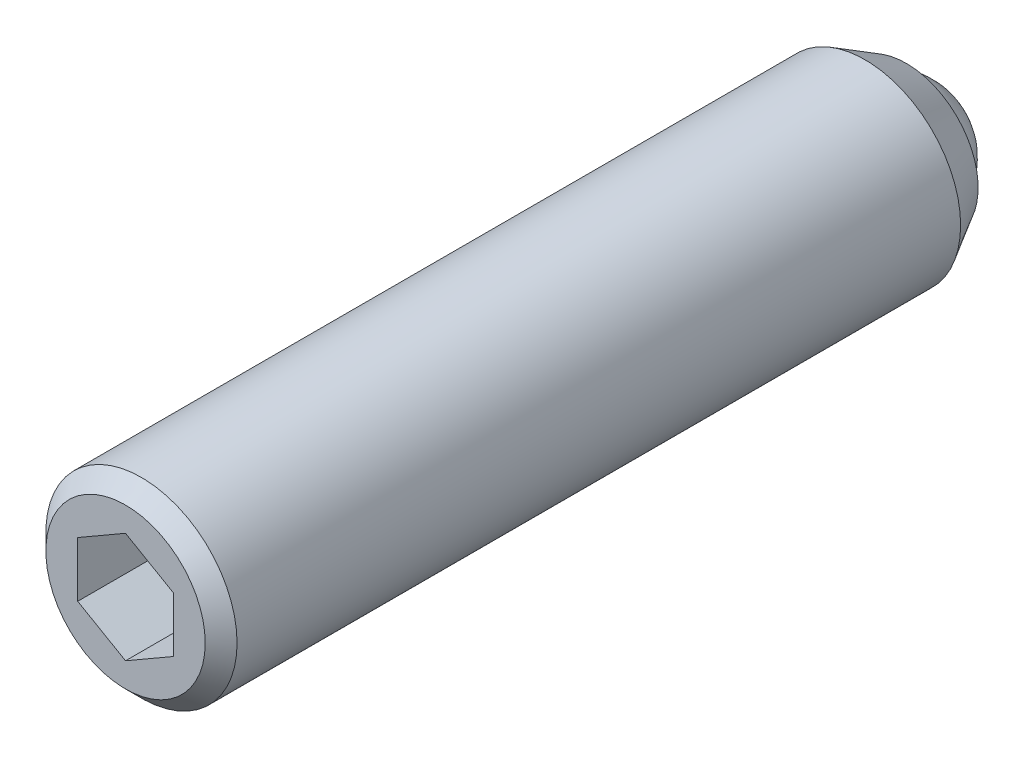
ISO-10303-21;
HEADER;
FILE_DESCRIPTION(('STEP AP214'),'2;1');
FILE_NAME('part.step','',(''),(''),'','','');
FILE_SCHEMA(('AUTOMOTIVE_DESIGN { 1 0 10303 214 1 1 1 1 }'));
ENDSEC;
DATA;
#1=APPLICATION_CONTEXT('core data for automotive mechanical design processes');
#2=APPLICATION_PROTOCOL_DEFINITION('international standard','automotive_design',2000,#1);
#3=PRODUCT_CONTEXT('',#1,'mechanical');
#4=PRODUCT('Part','Part','',(#3));
#5=PRODUCT_RELATED_PRODUCT_CATEGORY('part','',(#4));
#6=PRODUCT_DEFINITION_FORMATION('','',#4);
#7=PRODUCT_DEFINITION_CONTEXT('part definition',#1,'design');
#8=PRODUCT_DEFINITION('design','',#6,#7);
#9=PRODUCT_DEFINITION_SHAPE('','',#8);
#10=(LENGTH_UNIT() NAMED_UNIT(*) SI_UNIT(.MILLI.,.METRE.));
#11=(NAMED_UNIT(*) PLANE_ANGLE_UNIT() SI_UNIT($,.RADIAN.));
#12=(NAMED_UNIT(*) SI_UNIT($,.STERADIAN.) SOLID_ANGLE_UNIT());
#13=UNCERTAINTY_MEASURE_WITH_UNIT(LENGTH_MEASURE(1.E-05),#10,'distance_accuracy_value','');
#14=(GEOMETRIC_REPRESENTATION_CONTEXT(3) GLOBAL_UNCERTAINTY_ASSIGNED_CONTEXT((#13)) GLOBAL_UNIT_ASSIGNED_CONTEXT((#10,
#11,#12)) REPRESENTATION_CONTEXT('',''));
#15=CARTESIAN_POINT('',(0.,0.,0.));
#16=DIRECTION('',(0.,0.,1.));
#17=DIRECTION('',(1.,0.,0.));
#18=AXIS2_PLACEMENT_3D('',#15,#16,#17);
#19=CARTESIAN_POINT('',(1.5,0.866025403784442,23.4));
#20=DIRECTION('',(0.5,0.86602540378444,0.));
#21=DIRECTION('',(0.86602540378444,-0.5,0.));
#22=AXIS2_PLACEMENT_3D('',#19,#20,#21);
#23=PLANE('',#22);
#24=DIRECTION('',(0.,0.,1.));
#25=VECTOR('',#24,1.);
#26=CARTESIAN_POINT('',(1.5,0.866025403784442,23.4));
#27=LINE('',#26,#25);
#28=CARTESIAN_POINT('',(1.5,0.866025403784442,22.9));
#29=VERTEX_POINT('',#28);
#30=CARTESIAN_POINT('',(1.5,0.866025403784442,25.9));
#31=VERTEX_POINT('',#30);
#32=EDGE_CURVE('E68',#29,#31,#27,.T.);
#33=ORIENTED_EDGE('',*,*,#32,.T.);
#34=DIRECTION('',(-0.86602540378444,0.5,0.));
#35=VECTOR('',#34,1.);
#36=CARTESIAN_POINT('',(1.5,0.866025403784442,25.9));
#37=LINE('',#36,#35);
#38=CARTESIAN_POINT('',(0.,1.73205080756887,25.9));
#39=VERTEX_POINT('',#38);
#40=EDGE_CURVE('E29',#31,#39,#37,.T.);
#41=ORIENTED_EDGE('',*,*,#40,.T.);
#42=DIRECTION('',(0.,0.,1.));
#43=VECTOR('',#42,1.);
#44=CARTESIAN_POINT('',(0.,1.73205080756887,23.4));
#45=LINE('',#44,#43);
#46=CARTESIAN_POINT('',(0.,1.73205080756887,22.9));
#47=VERTEX_POINT('',#46);
#48=EDGE_CURVE('E80',#47,#39,#45,.T.);
#49=ORIENTED_EDGE('',*,*,#48,.F.);
#50=DIRECTION('',(-0.86602540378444,0.5,0.));
#51=VECTOR('',#50,1.);
#52=CARTESIAN_POINT('',(1.5,0.866025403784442,22.9));
#53=LINE('',#52,#51);
#54=EDGE_CURVE('E79',#29,#47,#53,.T.);
#55=ORIENTED_EDGE('',*,*,#54,.F.);
#56=EDGE_LOOP('',(#33,#41,#49,#55));
#57=FACE_BOUND('',#56,.T.);
#58=ADVANCED_FACE('F14',(#57),#23,.F.);
#59=CARTESIAN_POINT('',(1.5,-0.866025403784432,23.4));
#60=DIRECTION('',(1.,0.,0.));
#61=DIRECTION('',(0.,-1.,0.));
#62=AXIS2_PLACEMENT_3D('',#59,#60,#61);
#63=PLANE('',#62);
#64=DIRECTION('',(0.,0.,1.));
#65=VECTOR('',#64,1.);
#66=CARTESIAN_POINT('',(1.5,-0.866025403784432,23.4));
#67=LINE('',#66,#65);
#68=CARTESIAN_POINT('',(1.5,-0.866025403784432,22.9));
#69=VERTEX_POINT('',#68);
#70=CARTESIAN_POINT('',(1.5,-0.866025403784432,25.9));
#71=VERTEX_POINT('',#70);
#72=EDGE_CURVE('E76',#69,#71,#67,.T.);
#73=ORIENTED_EDGE('',*,*,#72,.T.);
#74=DIRECTION('',(0.,1.,0.));
#75=VECTOR('',#74,1.);
#76=CARTESIAN_POINT('',(1.5,-0.866025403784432,25.9));
#77=LINE('',#76,#75);
#78=EDGE_CURVE('E75',#71,#31,#77,.T.);
#79=ORIENTED_EDGE('',*,*,#78,.T.);
#80=ORIENTED_EDGE('',*,*,#32,.F.);
#81=DIRECTION('',(0.,1.,0.));
#82=VECTOR('',#81,1.);
#83=CARTESIAN_POINT('',(1.5,-0.866025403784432,22.9));
#84=LINE('',#83,#82);
#85=EDGE_CURVE('E72',#69,#29,#84,.T.);
#86=ORIENTED_EDGE('',*,*,#85,.F.);
#87=EDGE_LOOP('',(#73,#79,#80,#86));
#88=FACE_BOUND('',#87,.T.);
#89=ADVANCED_FACE('F70',(#88),#63,.F.);
#90=CARTESIAN_POINT('',(1.5,-0.866025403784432,23.4));
#91=DIRECTION('',(-0.5,0.866025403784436,0.));
#92=DIRECTION('',(0.866025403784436,0.5,0.));
#93=AXIS2_PLACEMENT_3D('',#90,#91,#92);
#94=PLANE('',#93);
#95=DIRECTION('',(0.,0.,1.));
#96=VECTOR('',#95,1.);
#97=CARTESIAN_POINT('',(0.,-1.73205080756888,23.4));
#98=LINE('',#97,#96);
#99=CARTESIAN_POINT('',(0.,-1.73205080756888,22.9));
#100=VERTEX_POINT('',#99);
#101=CARTESIAN_POINT('',(0.,-1.73205080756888,25.9));
#102=VERTEX_POINT('',#101);
#103=EDGE_CURVE('E122',#100,#102,#98,.T.);
#104=ORIENTED_EDGE('',*,*,#103,.T.);
#105=DIRECTION('',(-0.866025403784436,-0.5,0.));
#106=VECTOR('',#105,1.);
#107=CARTESIAN_POINT('',(1.5,-0.866025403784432,25.9));
#108=LINE('',#107,#106);
#109=EDGE_CURVE('E113',#71,#102,#108,.T.);
#110=ORIENTED_EDGE('',*,*,#109,.F.);
#111=ORIENTED_EDGE('',*,*,#72,.F.);
#112=DIRECTION('',(0.866025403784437,0.5,0.));
#113=VECTOR('',#112,1.);
#114=CARTESIAN_POINT('',(0.,-1.73205080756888,22.9));
#115=LINE('',#114,#113);
#116=EDGE_CURVE('E89',#100,#69,#115,.T.);
#117=ORIENTED_EDGE('',*,*,#116,.F.);
#118=EDGE_LOOP('',(#104,#110,#111,#117));
#119=FACE_BOUND('',#118,.T.);
#120=ADVANCED_FACE('F147',(#119),#94,.T.);
#121=CARTESIAN_POINT('',(-1.5,-0.866025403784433,23.4));
#122=DIRECTION('',(-0.5,-0.866025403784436,0.));
#123=DIRECTION('',(-0.866025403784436,0.5,0.));
#124=AXIS2_PLACEMENT_3D('',#121,#122,#123);
#125=PLANE('',#124);
#126=DIRECTION('',(0.,0.,1.));
#127=VECTOR('',#126,1.);
#128=CARTESIAN_POINT('',(-1.5,-0.866025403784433,23.4));
#129=LINE('',#128,#127);
#130=CARTESIAN_POINT('',(-1.5,-0.866025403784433,22.9));
#131=VERTEX_POINT('',#130);
#132=CARTESIAN_POINT('',(-1.5,-0.866025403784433,25.9));
#133=VERTEX_POINT('',#132);
#134=EDGE_CURVE('E120',#131,#133,#129,.T.);
#135=ORIENTED_EDGE('',*,*,#134,.T.);
#136=DIRECTION('',(0.866025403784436,-0.5,0.));
#137=VECTOR('',#136,1.);
#138=CARTESIAN_POINT('',(-1.5,-0.866025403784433,25.9));
#139=LINE('',#138,#137);
#140=EDGE_CURVE('E111',#133,#102,#139,.T.);
#141=ORIENTED_EDGE('',*,*,#140,.T.);
#142=ORIENTED_EDGE('',*,*,#103,.F.);
#143=DIRECTION('',(0.866025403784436,-0.5,0.));
#144=VECTOR('',#143,1.);
#145=CARTESIAN_POINT('',(-1.5,-0.866025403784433,22.9));
#146=LINE('',#145,#144);
#147=EDGE_CURVE('E101',#131,#100,#146,.T.);
#148=ORIENTED_EDGE('',*,*,#147,.F.);
#149=EDGE_LOOP('',(#135,#141,#142,#148));
#150=FACE_BOUND('',#149,.T.);
#151=ADVANCED_FACE('F157',(#150),#125,.F.);
#152=CARTESIAN_POINT('',(-1.5,-0.866025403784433,23.4));
#153=DIRECTION('',(1.,0.,0.));
#154=DIRECTION('',(0.,-1.,0.));
#155=AXIS2_PLACEMENT_3D('',#152,#153,#154);
#156=PLANE('',#155);
#157=DIRECTION('',(0.,0.,1.));
#158=VECTOR('',#157,1.);
#159=CARTESIAN_POINT('',(-1.5,0.866025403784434,23.4));
#160=LINE('',#159,#158);
#161=CARTESIAN_POINT('',(-1.5,0.866025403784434,22.9));
#162=VERTEX_POINT('',#161);
#163=CARTESIAN_POINT('',(-1.5,0.866025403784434,25.9));
#164=VERTEX_POINT('',#163);
#165=EDGE_CURVE('E37',#162,#164,#160,.T.);
#166=ORIENTED_EDGE('',*,*,#165,.T.);
#167=DIRECTION('',(0.,1.,0.));
#168=VECTOR('',#167,1.);
#169=CARTESIAN_POINT('',(-1.5,-0.866025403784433,25.9));
#170=LINE('',#169,#168);
#171=EDGE_CURVE('E108',#133,#164,#170,.T.);
#172=ORIENTED_EDGE('',*,*,#171,.F.);
#173=ORIENTED_EDGE('',*,*,#134,.F.);
#174=DIRECTION('',(0.,-1.,0.));
#175=VECTOR('',#174,1.);
#176=CARTESIAN_POINT('',(-1.5,0.866025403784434,22.9));
#177=LINE('',#176,#175);
#178=EDGE_CURVE('E98',#162,#131,#177,.T.);
#179=ORIENTED_EDGE('',*,*,#178,.F.);
#180=EDGE_LOOP('',(#166,#172,#173,#179));
#181=FACE_BOUND('',#180,.T.);
#182=ADVANCED_FACE('F153',(#181),#156,.T.);
#183=CARTESIAN_POINT('',(-1.5,0.866025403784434,23.4));
#184=DIRECTION('',(0.5,-0.866025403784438,0.));
#185=DIRECTION('',(-0.866025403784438,-0.5,0.));
#186=AXIS2_PLACEMENT_3D('',#183,#184,#185);
#187=PLANE('',#186);
#188=ORIENTED_EDGE('',*,*,#165,.F.);
#189=DIRECTION('',(-0.866025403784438,-0.5,0.));
#190=VECTOR('',#189,1.);
#191=CARTESIAN_POINT('',(0.,1.73205080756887,22.9));
#192=LINE('',#191,#190);
#193=EDGE_CURVE('E84',#47,#162,#192,.T.);
#194=ORIENTED_EDGE('',*,*,#193,.F.);
#195=ORIENTED_EDGE('',*,*,#48,.T.);
#196=DIRECTION('',(0.866025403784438,0.5,0.));
#197=VECTOR('',#196,1.);
#198=CARTESIAN_POINT('',(-1.5,0.866025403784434,25.9));
#199=LINE('',#198,#197);
#200=EDGE_CURVE('E105',#164,#39,#199,.T.);
#201=ORIENTED_EDGE('',*,*,#200,.F.);
#202=EDGE_LOOP('',(#188,#194,#195,#201));
#203=FACE_BOUND('',#202,.T.);
#204=ADVANCED_FACE('F150',(#203),#187,.T.);
#205=CARTESIAN_POINT('',(0.,0.,25.65));
#206=DIRECTION('',(0.,0.,-1.));
#207=DIRECTION('',(1.,0.,0.));
#208=AXIS2_PLACEMENT_3D('',#205,#206,#207);
#209=CYLINDRICAL_SURFACE('',#208,3.);
#210=CARTESIAN_POINT('',(0.,0.,25.4));
#211=DIRECTION('',(0.,0.,-1.));
#212=DIRECTION('',(1.,0.,0.));
#213=AXIS2_PLACEMENT_3D('',#210,#211,#212);
#214=CIRCLE('',#213,3.);
#215=CARTESIAN_POINT('',(3.,0.,25.4));
#216=VERTEX_POINT('',#215);
#217=EDGE_CURVE('E9',#216,#216,#214,.T.);
#218=ORIENTED_EDGE('',*,*,#217,.T.);
#219=EDGE_LOOP('',(#218));
#220=FACE_BOUND('',#219,.T.);
#221=CARTESIAN_POINT('',(0.,0.,2.69903810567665));
#222=DIRECTION('',(0.,0.,-1.));
#223=DIRECTION('',(-1.,0.,0.));
#224=AXIS2_PLACEMENT_3D('',#221,#222,#223);
#225=CIRCLE('',#224,3.);
#226=CARTESIAN_POINT('',(-3.,0.,2.69903810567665));
#227=VERTEX_POINT('',#226);
#228=EDGE_CURVE('E244',#227,#227,#225,.T.);
#229=ORIENTED_EDGE('',*,*,#228,.F.);
#230=EDGE_LOOP('',(#229));
#231=FACE_BOUND('',#230,.T.);
#232=ADVANCED_FACE('F16',(#220,#231),#209,.T.);
#233=CARTESIAN_POINT('',(0.,0.,25.4));
#234=DIRECTION('',(0.,0.,-1.));
#235=DIRECTION('',(1.,0.,0.));
#236=AXIS2_PLACEMENT_3D('',#233,#234,#235);
#237=CONICAL_SURFACE('',#236,3.,0.785398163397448);
#238=CARTESIAN_POINT('',(0.,0.,25.9));
#239=DIRECTION('',(0.,0.,-1.));
#240=DIRECTION('',(1.,0.,0.));
#241=AXIS2_PLACEMENT_3D('',#238,#239,#240);
#242=CIRCLE('',#241,2.5);
#243=CARTESIAN_POINT('',(2.5,0.,25.9));
#244=VERTEX_POINT('',#243);
#245=EDGE_CURVE('E22',#244,#244,#242,.T.);
#246=ORIENTED_EDGE('',*,*,#245,.T.);
#247=EDGE_LOOP('',(#246));
#248=FACE_BOUND('',#247,.T.);
#249=ORIENTED_EDGE('',*,*,#217,.F.);
#250=EDGE_LOOP('',(#249));
#251=FACE_BOUND('',#250,.T.);
#252=ADVANCED_FACE('F127',(#248,#251),#237,.T.);
#253=CARTESIAN_POINT('',(0.,0.,25.9));
#254=DIRECTION('',(0.,0.,-1.));
#255=DIRECTION('',(1.,0.,0.));
#256=AXIS2_PLACEMENT_3D('',#253,#254,#255);
#257=PLANE('',#256);
#258=ORIENTED_EDGE('',*,*,#200,.T.);
#259=ORIENTED_EDGE('',*,*,#40,.F.);
#260=ORIENTED_EDGE('',*,*,#78,.F.);
#261=ORIENTED_EDGE('',*,*,#109,.T.);
#262=ORIENTED_EDGE('',*,*,#140,.F.);
#263=ORIENTED_EDGE('',*,*,#171,.T.);
#264=EDGE_LOOP('',(#258,#259,#260,#261,#262,#263));
#265=FACE_BOUND('',#264,.T.);
#266=ORIENTED_EDGE('',*,*,#245,.F.);
#267=EDGE_LOOP('',(#266));
#268=FACE_BOUND('',#267,.T.);
#269=ADVANCED_FACE('F130',(#265,#268),#257,.F.);
#270=CARTESIAN_POINT('',(1.5,0.866025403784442,22.9));
#271=DIRECTION('',(0.,0.,1.));
#272=DIRECTION('',(1.,0.,0.));
#273=AXIS2_PLACEMENT_3D('',#270,#271,#272);
#274=PLANE('',#273);
#275=ORIENTED_EDGE('',*,*,#85,.T.);
#276=ORIENTED_EDGE('',*,*,#54,.T.);
#277=ORIENTED_EDGE('',*,*,#193,.T.);
#278=ORIENTED_EDGE('',*,*,#178,.T.);
#279=ORIENTED_EDGE('',*,*,#147,.T.);
#280=ORIENTED_EDGE('',*,*,#116,.T.);
#281=EDGE_LOOP('',(#275,#276,#277,#278,#279,#280));
#282=FACE_BOUND('',#281,.T.);
#283=ADVANCED_FACE('F86',(#282),#274,.T.);
#284=CARTESIAN_POINT('',(0.,0.,2.));
#285=DIRECTION('',(0.,0.,-1.));
#286=DIRECTION('',(-1.,0.,0.));
#287=AXIS2_PLACEMENT_3D('',#284,#285,#286);
#288=SPHERICAL_SURFACE('',#287,2.);
#289=CARTESIAN_POINT('',(0.,0.,1.4));
#290=DIRECTION('',(0.,0.,-1.));
#291=DIRECTION('',(-1.,0.,0.));
#292=AXIS2_PLACEMENT_3D('',#289,#290,#291);
#293=CIRCLE('',#292,1.90787840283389);
#294=CARTESIAN_POINT('',(-1.90787840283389,0.,1.4));
#295=VERTEX_POINT('',#294);
#296=EDGE_CURVE('E90',#295,#295,#293,.T.);
#297=ORIENTED_EDGE('',*,*,#296,.T.);
#298=EDGE_LOOP('',(#297));
#299=FACE_BOUND('',#298,.T.);
#300=ADVANCED_FACE('F139',(#299),#288,.T.);
#301=CARTESIAN_POINT('',(-1.90787840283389,0.,1.4));
#302=DIRECTION('',(0.,0.,-1.));
#303=DIRECTION('',(-1.,0.,0.));
#304=AXIS2_PLACEMENT_3D('',#301,#302,#303);
#305=PLANE('',#304);
#306=CARTESIAN_POINT('',(0.,0.,1.4));
#307=DIRECTION('',(0.,0.,-1.));
#308=DIRECTION('',(-1.,0.,0.));
#309=AXIS2_PLACEMENT_3D('',#306,#307,#308);
#310=CIRCLE('',#309,2.25);
#311=CARTESIAN_POINT('',(-2.25,0.,1.4));
#312=VERTEX_POINT('',#311);
#313=EDGE_CURVE('E93',#312,#312,#310,.T.);
#314=ORIENTED_EDGE('',*,*,#313,.T.);
#315=EDGE_LOOP('',(#314));
#316=FACE_BOUND('',#315,.T.);
#317=ORIENTED_EDGE('',*,*,#296,.F.);
#318=EDGE_LOOP('',(#317));
#319=FACE_BOUND('',#318,.T.);
#320=ADVANCED_FACE('F216',(#316,#319),#305,.T.);
#321=CARTESIAN_POINT('',(0.,0.,1.4));
#322=DIRECTION('',(0.,0.,1.));
#323=DIRECTION('',(1.,0.,0.));
#324=AXIS2_PLACEMENT_3D('',#321,#322,#323);
#325=CONICAL_SURFACE('',#324,2.25,0.523598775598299);
#326=ORIENTED_EDGE('',*,*,#228,.T.);
#327=EDGE_LOOP('',(#326));
#328=FACE_BOUND('',#327,.T.);
#329=ORIENTED_EDGE('',*,*,#313,.F.);
#330=EDGE_LOOP('',(#329));
#331=FACE_BOUND('',#330,.T.);
#332=ADVANCED_FACE('F225',(#328,#331),#325,.T.);
#333=CLOSED_SHELL('',(#58,#89,#120,#151,#182,#204,#232,#252,#269,#283,#300,#320,#332));
#334=MANIFOLD_SOLID_BREP('B1',#333);
#335=ADVANCED_BREP_SHAPE_REPRESENTATION('',(#18,#334),#14);
#336=SHAPE_DEFINITION_REPRESENTATION(#9,#335);
ENDSEC;
END-ISO-10303-21;
